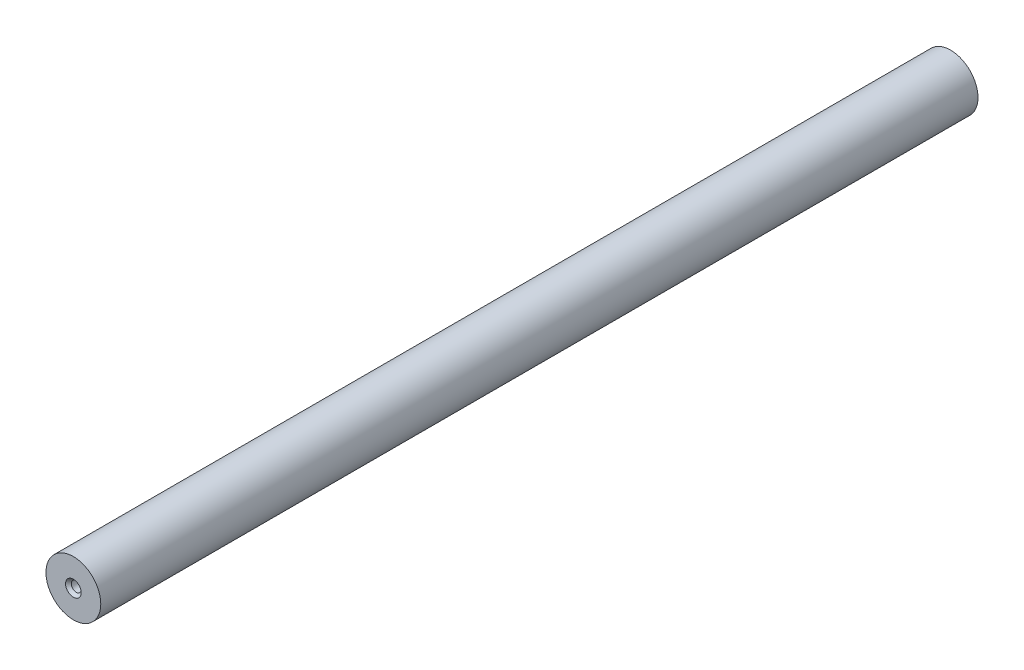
from build123d import *

# Parameters (mm, degrees)
SKETCH1_R                       = 9.525
BOSS_EXTRUDE1_DEPTH             = 304.8
F_8_32_TAPPED_HOLE1_D           = 3.4544
F_8_32_TAPPED_HOLE1_DEPTH       = 12.7
F_8_32_TAPPED_HOLE1_CSINK_D     = 5.4356
F_8_32_TAPPED_HOLE1_CSINK_ANGLE = 90
F_8_32_TAPPED_HOLE1_TIP         = 1.037806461
F_8_32_TAPPED_HOLE2_D           = 3.4544
F_8_32_TAPPED_HOLE2_DEPTH       = 12.7
F_8_32_TAPPED_HOLE2_CSINK_D     = 5.4356
F_8_32_TAPPED_HOLE2_CSINK_ANGLE = 90
F_8_32_TAPPED_HOLE2_TIP         = 1.037806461


with BuildPart() as part:
    # Sketch1 → Boss-Extrude1 (new body)
    with BuildSketch(Plane.XY):
        with Locations((-17.85669821, 5.70677984)):
            Circle(SKETCH1_R)
    extrude(amount=-BOSS_EXTRUDE1_DEPTH)

    # 8-32 Tapped Hole1
    with Locations(Plane.XY):
        with Locations((-17.85669821, 5.70677984)):
            CounterSinkHole(F_8_32_TAPPED_HOLE1_D / 2, F_8_32_TAPPED_HOLE1_CSINK_D / 2, depth=F_8_32_TAPPED_HOLE1_DEPTH, counter_sink_angle=F_8_32_TAPPED_HOLE1_CSINK_ANGLE)
            with Locations((0, 0, -(F_8_32_TAPPED_HOLE1_DEPTH + F_8_32_TAPPED_HOLE1_TIP / 2))):  # 118° drill point
                Cone(0, F_8_32_TAPPED_HOLE1_D / 2, F_8_32_TAPPED_HOLE1_TIP, mode=Mode.SUBTRACT)

    # 8-32 Tapped Hole2
    with Locations(Plane(origin=(0, 0, -304.8), x_dir=(-1, 0, 0), z_dir=(0, 0, -1))):
        with Locations((17.85669821, 5.70677984)):
            CounterSinkHole(F_8_32_TAPPED_HOLE2_D / 2, F_8_32_TAPPED_HOLE2_CSINK_D / 2, depth=F_8_32_TAPPED_HOLE2_DEPTH, counter_sink_angle=F_8_32_TAPPED_HOLE2_CSINK_ANGLE)
            with Locations((0, 0, -(F_8_32_TAPPED_HOLE2_DEPTH + F_8_32_TAPPED_HOLE2_TIP / 2))):  # 118° drill point
                Cone(0, F_8_32_TAPPED_HOLE2_D / 2, F_8_32_TAPPED_HOLE2_TIP, mode=Mode.SUBTRACT)


solid = part.part
